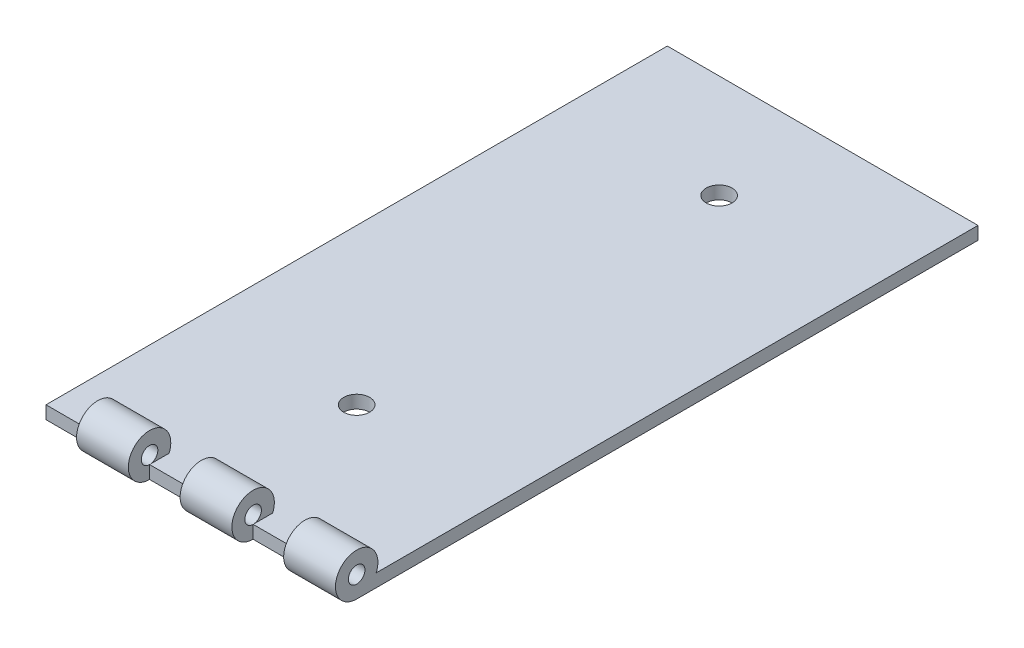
from build123d import *

# Parameters (mm, degrees)
SKETCH1_W               = 38.1
SKETCH1_H               = 76.2
BOSS_EXTRUDE1_DEPTH     = 1.5875
SKETCH2_R               = 2.6035
SKETCH2_R_2             = 1.016
BOSS_EXTRUDE2_DEPTH     = 6.35
LPATTERN1_COUNT         = 3
LPATTERN1_PITCH         = 12.7
CUT_EXTRUDE1_DEPTH      = 46.086341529
CUT_EXTRUDE1_DEPTH_BACK = 46.086341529
SKETCH5_R               = 1.5875


with BuildPart() as part:
    # Sketch1 → Boss-Extrude1 (new body)
    with BuildSketch(Plane(origin=(0, 0, 0), x_dir=(1, 0, 0), z_dir=(0, 1, 0))):
        Rectangle(SKETCH1_W, SKETCH1_H)
    extrude(amount=BOSS_EXTRUDE1_DEPTH)

    # Sketch2 → Boss-Extrude2 (add)
    with BuildSketch(Plane(origin=(19.05, 0, 0), x_dir=(0, 0, -1), z_dir=(1, 0, 0))):
        with Locations((-38.1, 2.6035)):
            Circle(SKETCH2_R)
        with Locations((-38.1, 2.6035)):
            Circle(SKETCH2_R_2, mode=Mode.SUBTRACT)
    boss_extrude2 = extrude(amount=-BOSS_EXTRUDE2_DEPTH)

    # LPattern1: Boss-Extrude2 ×3
    with Locations(*[(-i * LPATTERN1_PITCH, 0, 0) for i in range(1, LPATTERN1_COUNT)]):
        add(boss_extrude2)

    # Sketch5 → Cut-Extrude1 (cut, two sides: drawn at the far end of the back side and taken through both)
    with BuildSketch(Plane(origin=(0, 1.5875, 0), x_dir=(1, 0, 0), z_dir=(0, 1, 0)).offset(-CUT_EXTRUDE1_DEPTH_BACK)):
        with Locations(Location((0, 25.4, 0), (0, 0, 270))):
            Circle(SKETCH5_R)
        with Locations(Location((0, -19.05, 0), (0, 0, 270))):
            Circle(SKETCH5_R)
    extrude(amount=CUT_EXTRUDE1_DEPTH + CUT_EXTRUDE1_DEPTH_BACK, mode=Mode.SUBTRACT)


solid = part.part
